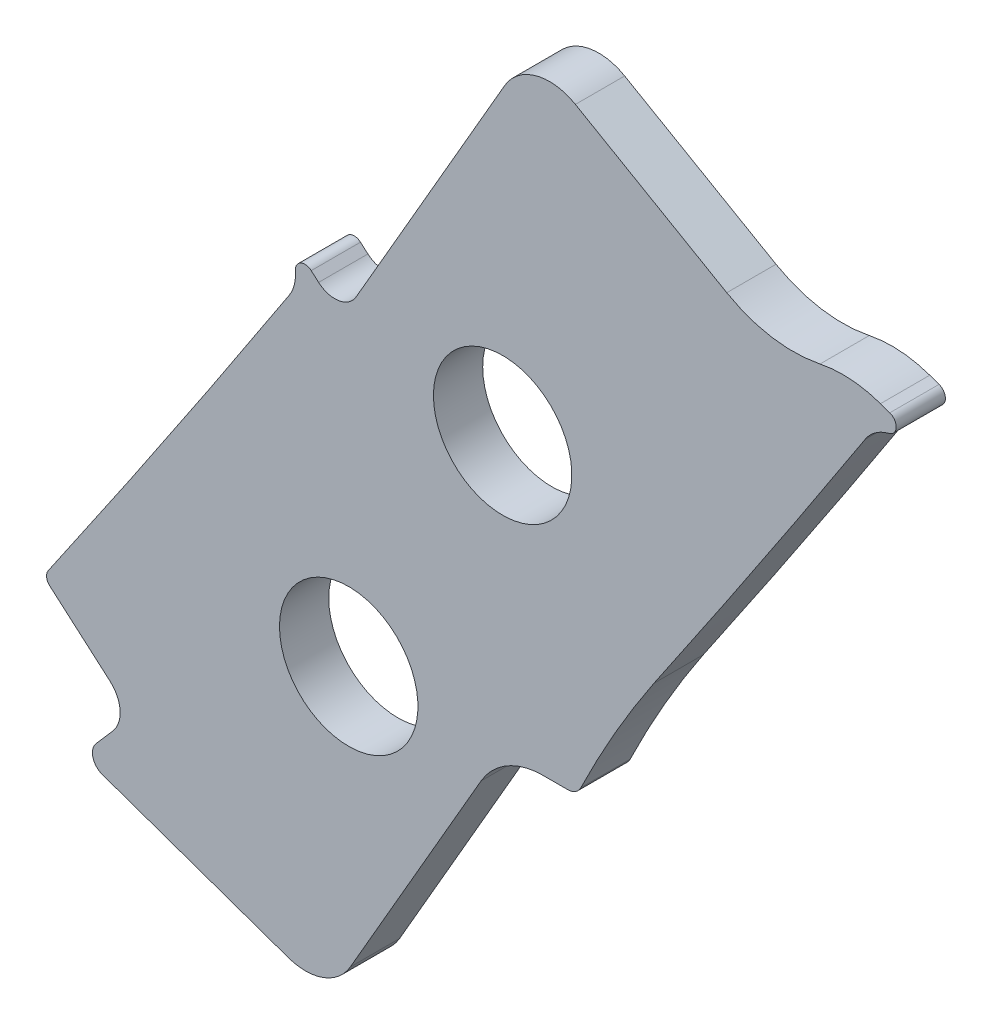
ISO-10303-21;
HEADER;
FILE_DESCRIPTION(('STEP AP214'),'2;1');
FILE_NAME('part.step','',(''),(''),'','','');
FILE_SCHEMA(('AUTOMOTIVE_DESIGN { 1 0 10303 214 1 1 1 1 }'));
ENDSEC;
DATA;
#1=APPLICATION_CONTEXT('core data for automotive mechanical design processes');
#2=APPLICATION_PROTOCOL_DEFINITION('international standard','automotive_design',2000,#1);
#3=PRODUCT_CONTEXT('',#1,'mechanical');
#4=PRODUCT('Part','Part','',(#3));
#5=PRODUCT_RELATED_PRODUCT_CATEGORY('part','',(#4));
#6=PRODUCT_DEFINITION_FORMATION('','',#4);
#7=PRODUCT_DEFINITION_CONTEXT('part definition',#1,'design');
#8=PRODUCT_DEFINITION('design','',#6,#7);
#9=PRODUCT_DEFINITION_SHAPE('','',#8);
#10=(LENGTH_UNIT() NAMED_UNIT(*) SI_UNIT(.MILLI.,.METRE.));
#11=(NAMED_UNIT(*) PLANE_ANGLE_UNIT() SI_UNIT($,.RADIAN.));
#12=(NAMED_UNIT(*) SI_UNIT($,.STERADIAN.) SOLID_ANGLE_UNIT());
#13=UNCERTAINTY_MEASURE_WITH_UNIT(LENGTH_MEASURE(1.E-05),#10,'distance_accuracy_value','');
#14=(GEOMETRIC_REPRESENTATION_CONTEXT(3) GLOBAL_UNCERTAINTY_ASSIGNED_CONTEXT((#13)) GLOBAL_UNIT_ASSIGNED_CONTEXT((#10,
#11,#12)) REPRESENTATION_CONTEXT('',''));
#15=CARTESIAN_POINT('',(0.,0.,0.));
#16=DIRECTION('',(0.,0.,1.));
#17=DIRECTION('',(1.,0.,0.));
#18=AXIS2_PLACEMENT_3D('',#15,#16,#17);
#19=CARTESIAN_POINT('',(-1079.32610530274,4.08105234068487,-2.54));
#20=DIRECTION('',(0.,0.,1.));
#21=DIRECTION('',(1.,0.,0.));
#22=AXIS2_PLACEMENT_3D('',#19,#20,#21);
#23=PLANE('',#22);
#24=CARTESIAN_POINT('',(-1082.675,17.4625,-2.54));
#25=DIRECTION('',(0.,0.,-1.));
#26=DIRECTION('',(-1.,0.,0.));
#27=AXIS2_PLACEMENT_3D('',#24,#25,#26);
#28=CIRCLE('',#27,3.56869999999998);
#29=CARTESIAN_POINT('',(-1086.2437,17.4625,-2.54));
#30=VERTEX_POINT('',#29);
#31=EDGE_CURVE('E468',#30,#30,#28,.T.);
#32=ORIENTED_EDGE('',*,*,#31,.F.);
#33=EDGE_LOOP('',(#32));
#34=FACE_BOUND('',#33,.T.);
#35=CARTESIAN_POINT('',(-1079.32610530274,4.08105234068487,-2.54));
#36=DIRECTION('',(0.,0.,1.));
#37=DIRECTION('',(1.,0.,0.));
#38=AXIS2_PLACEMENT_3D('',#35,#36,#37);
#39=CIRCLE('',#38,0.761999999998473);
#40=CARTESIAN_POINT('',(-1079.32610530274,3.31905234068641,-2.54));
#41=VERTEX_POINT('',#40);
#42=CARTESIAN_POINT('',(-1078.64073042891,3.74802789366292,-2.54));
#43=VERTEX_POINT('',#42);
#44=EDGE_CURVE('E359',#41,#43,#39,.T.);
#45=ORIENTED_EDGE('',*,*,#44,.F.);
#46=DIRECTION('',(1.,-3.95708181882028E-12,0.));
#47=VECTOR('',#46,1.);
#48=CARTESIAN_POINT('',(-1080.59610530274,3.31905234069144,-2.54));
#49=LINE('',#48,#47);
#50=CARTESIAN_POINT('',(-1080.59610530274,3.31905234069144,-2.54));
#51=VERTEX_POINT('',#50);
#52=EDGE_CURVE('E243',#51,#41,#49,.T.);
#53=ORIENTED_EDGE('',*,*,#52,.F.);
#54=CARTESIAN_POINT('',(-1080.59610530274,-0.363947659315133,-2.54));
#55=DIRECTION('',(0.,0.,-1.));
#56=DIRECTION('',(1.,0.,0.));
#57=AXIS2_PLACEMENT_3D('',#54,#55,#56);
#58=CIRCLE('',#57,3.68300000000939);
#59=CARTESIAN_POINT('',(-1083.78567686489,1.47755234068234,-2.54));
#60=VERTEX_POINT('',#59);
#61=EDGE_CURVE('E227',#60,#51,#58,.T.);
#62=ORIENTED_EDGE('',*,*,#61,.F.);
#63=DIRECTION('',(0.500000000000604,0.86602540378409,0.));
#64=VECTOR('',#63,1.);
#65=CARTESIAN_POINT('',(-1090.52925738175,-10.2026717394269,-2.54));
#66=LINE('',#65,#64);
#67=CARTESIAN_POINT('',(-1090.52925738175,-10.2026717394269,-2.54));
#68=VERTEX_POINT('',#67);
#69=EDGE_CURVE('E241',#68,#60,#66,.T.);
#70=ORIENTED_EDGE('',*,*,#69,.F.);
#71=CARTESIAN_POINT('',(-1092.83894713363,-8.86917173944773,-2.54));
#72=DIRECTION('',(0.,0.,1.));
#73=DIRECTION('',(1.,0.,0.));
#74=AXIS2_PLACEMENT_3D('',#71,#72,#73);
#75=CIRCLE('',#74,2.66699999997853);
#76=CARTESIAN_POINT('',(-1093.72551577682,-11.3845017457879,-2.54));
#77=VERTEX_POINT('',#76);
#78=EDGE_CURVE('E248',#77,#68,#75,.T.);
#79=ORIENTED_EDGE('',*,*,#78,.F.);
#80=DIRECTION('',(0.943130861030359,-0.332421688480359,0.));
#81=VECTOR('',#80,1.);
#82=CARTESIAN_POINT('',(-1103.31705452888,-8.00380916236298,-2.54));
#83=LINE('',#82,#81);
#84=CARTESIAN_POINT('',(-1103.31705452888,-8.00380916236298,-2.54));
#85=VERTEX_POINT('',#84);
#86=EDGE_CURVE('E252',#85,#77,#83,.T.);
#87=ORIENTED_EDGE('',*,*,#86,.F.);
#88=CARTESIAN_POINT('',(-1103.06374920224,-7.28514344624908,-2.54));
#89=DIRECTION('',(0.,0.,1.));
#90=DIRECTION('',(1.,0.,0.));
#91=AXIS2_PLACEMENT_3D('',#88,#89,#90);
#92=CIRCLE('',#91,0.762000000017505);
#93=CARTESIAN_POINT('',(-1103.63908213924,-6.78550756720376,-2.54));
#94=VERTEX_POINT('',#93);
#95=EDGE_CURVE('E556',#94,#85,#92,.T.);
#96=ORIENTED_EDGE('',*,*,#95,.F.);
#97=DIRECTION('',(-0.655690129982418,-0.755030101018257,0.));
#98=VECTOR('',#97,1.);
#99=CARTESIAN_POINT('',(-1102.76913566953,-5.78376033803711,-2.54));
#100=LINE('',#99,#98);
#101=CARTESIAN_POINT('',(-1102.76913566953,-5.78376033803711,-2.54));
#102=VERTEX_POINT('',#101);
#103=EDGE_CURVE('E552',#102,#94,#100,.T.);
#104=ORIENTED_EDGE('',*,*,#103,.F.);
#105=CARTESIAN_POINT('',(-1103.91980154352,-4.78448857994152,-2.54));
#106=DIRECTION('',(0.,0.,-1.));
#107=DIRECTION('',(1.,0.,0.));
#108=AXIS2_PLACEMENT_3D('',#105,#106,#107);
#109=CIRCLE('',#108,1.52400000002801);
#110=CARTESIAN_POINT('',(-1102.92052978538,-3.6338227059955,-2.54));
#111=VERTEX_POINT('',#110);
#112=EDGE_CURVE('E548',#111,#102,#109,.T.);
#113=ORIENTED_EDGE('',*,*,#112,.F.);
#114=DIRECTION('',(0.755030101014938,-0.65569012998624,0.));
#115=VECTOR('',#114,1.);
#116=CARTESIAN_POINT('',(-1106.02081050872,-0.941448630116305,-2.54));
#117=LINE('',#116,#115);
#118=CARTESIAN_POINT('',(-1106.02081050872,-0.941448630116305,-2.54));
#119=VERTEX_POINT('',#118);
#120=EDGE_CURVE('E544',#119,#111,#117,.T.);
#121=ORIENTED_EDGE('',*,*,#120,.F.);
#122=CARTESIAN_POINT('',(-1105.69821096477,-0.569973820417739,-2.54));
#123=DIRECTION('',(0.,0.,1.));
#124=DIRECTION('',(1.,0.,0.));
#125=AXIS2_PLACEMENT_3D('',#122,#123,#124);
#126=CIRCLE('',#125,0.491999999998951);
#127=CARTESIAN_POINT('',(-1106.10311749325,-0.290483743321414,-2.54));
#128=VERTEX_POINT('',#127);
#129=EDGE_CURVE('E540',#128,#119,#126,.T.);
#130=ORIENTED_EDGE('',*,*,#129,.F.);
#131=CARTESIAN_POINT('',(-1812.92046147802,487.596028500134,-2.54));
#132=DIRECTION('',(0.,0.,-1.));
#133=DIRECTION('',(1.,0.,0.));
#134=AXIS2_PLACEMENT_3D('',#131,#132,#133);
#135=CIRCLE('',#134,858.850398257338);
#136=CARTESIAN_POINT('',(-1093.68394171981,18.2104351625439,-2.54));
#137=VERTEX_POINT('',#136);
#138=EDGE_CURVE('E536',#137,#128,#135,.T.);
#139=ORIENTED_EDGE('',*,*,#138,.F.);
#140=CARTESIAN_POINT('',(-1095.38562179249,19.3209795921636,-2.54));
#141=DIRECTION('',(0.,0.,-1.));
#142=DIRECTION('',(1.,0.,0.));
#143=AXIS2_PLACEMENT_3D('',#140,#141,#142);
#144=CIRCLE('',#143,2.03200000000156);
#145=CARTESIAN_POINT('',(-1093.35945334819,19.474815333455,-2.54));
#146=VERTEX_POINT('',#145);
#147=EDGE_CURVE('E532',#146,#137,#144,.T.);
#148=ORIENTED_EDGE('',*,*,#147,.F.);
#149=CARTESIAN_POINT('',(-1092.86886531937,19.5120629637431,-2.54));
#150=DIRECTION('',(0.,0.,1.));
#151=DIRECTION('',(1.,0.,0.));
#152=AXIS2_PLACEMENT_3D('',#149,#150,#151);
#153=CIRCLE('',#152,0.491999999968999);
#154=CARTESIAN_POINT('',(-1092.54530847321,19.8827042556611,-2.54));
#155=VERTEX_POINT('',#154);
#156=EDGE_CURVE('E528',#155,#146,#153,.T.);
#157=ORIENTED_EDGE('',*,*,#156,.F.);
#158=DIRECTION('',(-0.753335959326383,0.657635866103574,0.));
#159=VECTOR('',#158,1.);
#160=CARTESIAN_POINT('',(-1092.16261380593,19.5486252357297,-2.54));
#161=LINE('',#160,#159);
#162=CARTESIAN_POINT('',(-1092.16261380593,19.5486252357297,-2.54));
#163=VERTEX_POINT('',#162);
#164=EDGE_CURVE('E524',#163,#155,#161,.T.);
#165=ORIENTED_EDGE('',*,*,#164,.F.);
#166=CARTESIAN_POINT('',(-1091.32741625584,20.5053619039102,-2.54));
#167=DIRECTION('',(0.,0.,-1.));
#168=DIRECTION('',(1.,0.,0.));
#169=AXIS2_PLACEMENT_3D('',#166,#167,#168);
#170=CIRCLE('',#169,1.26999999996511);
#171=CARTESIAN_POINT('',(-1090.22756399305,19.8703619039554,-2.54));
#172=VERTEX_POINT('',#171);
#173=EDGE_CURVE('E520',#172,#163,#170,.T.);
#174=ORIENTED_EDGE('',*,*,#173,.F.);
#175=DIRECTION('',(-0.500000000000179,-0.866025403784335,0.));
#176=VECTOR('',#175,1.);
#177=CARTESIAN_POINT('',(-1082.56644444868,33.1398101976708,-2.54));
#178=LINE('',#177,#176);
#179=CARTESIAN_POINT('',(-1082.56644444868,33.1398101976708,-2.54));
#180=VERTEX_POINT('',#179);
#181=EDGE_CURVE('E516',#180,#172,#178,.T.);
#182=ORIENTED_EDGE('',*,*,#181,.F.);
#183=CARTESIAN_POINT('',(-1080.25675469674,31.806310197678,-2.54));
#184=DIRECTION('',(0.,0.,1.));
#185=DIRECTION('',(1.,0.,0.));
#186=AXIS2_PLACEMENT_3D('',#183,#184,#185);
#187=CIRCLE('',#186,2.66700000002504);
#188=CARTESIAN_POINT('',(-1078.92325469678,34.1159999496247,-2.54));
#189=VERTEX_POINT('',#188);
#190=EDGE_CURVE('E512',#189,#180,#187,.T.);
#191=ORIENTED_EDGE('',*,*,#190,.F.);
#192=DIRECTION('',(-0.86602540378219,0.500000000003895,0.));
#193=VECTOR('',#192,1.);
#194=CARTESIAN_POINT('',(-1071.11913012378,29.6102865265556,-2.54));
#195=LINE('',#194,#193);
#196=CARTESIAN_POINT('',(-1071.11913012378,29.6102865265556,-2.54));
#197=VERTEX_POINT('',#196);
#198=EDGE_CURVE('E508',#197,#189,#195,.T.);
#199=ORIENTED_EDGE('',*,*,#198,.F.);
#200=CARTESIAN_POINT('',(-1067.69013012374,35.5494887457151,-2.54));
#201=DIRECTION('',(0.,0.,-1.));
#202=DIRECTION('',(1.,0.,0.));
#203=AXIS2_PLACEMENT_3D('',#200,#201,#202);
#204=CIRCLE('',#203,6.85800000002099);
#205=CARTESIAN_POINT('',(-1066.30960685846,28.8318761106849,-2.54));
#206=VERTEX_POINT('',#205);
#207=EDGE_CURVE('E504',#206,#197,#204,.T.);
#208=ORIENTED_EDGE('',*,*,#207,.F.);
#209=CARTESIAN_POINT('',(-1065.13360555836,23.109465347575,-2.54));
#210=DIRECTION('',(0.,0.,1.));
#211=DIRECTION('',(1.,0.,0.));
#212=AXIS2_PLACEMENT_3D('',#209,#210,#211);
#213=CIRCLE('',#212,5.84199999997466);
#214=CARTESIAN_POINT('',(-1063.19159805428,28.6192358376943,-2.54));
#215=VERTEX_POINT('',#214);
#216=EDGE_CURVE('E500',#215,#206,#213,.T.);
#217=ORIENTED_EDGE('',*,*,#216,.F.);
#218=DIRECTION('',(-0.943130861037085,0.332421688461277,0.));
#219=VECTOR('',#218,1.);
#220=CARTESIAN_POINT('',(-1062.71248757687,28.450365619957,-2.54));
#221=LINE('',#220,#219);
#222=CARTESIAN_POINT('',(-1062.71248757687,28.450365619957,-2.54));
#223=VERTEX_POINT('',#222);
#224=EDGE_CURVE('E496',#223,#215,#221,.T.);
#225=ORIENTED_EDGE('',*,*,#224,.F.);
#226=CARTESIAN_POINT('',(-1062.8760390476,27.9863452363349,-2.54));
#227=DIRECTION('',(0.,0.,1.));
#228=DIRECTION('',(1.,0.,0.));
#229=AXIS2_PLACEMENT_3D('',#226,#227,#228);
#230=CIRCLE('',#229,0.492000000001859);
#231=CARTESIAN_POINT('',(-1062.75789083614,27.5087418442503,-2.54));
#232=VERTEX_POINT('',#231);
#233=EDGE_CURVE('E492',#232,#223,#230,.T.);
#234=ORIENTED_EDGE('',*,*,#233,.F.);
#235=CARTESIAN_POINT('',(-1062.26992911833,25.5362010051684,-2.54));
#236=DIRECTION('',(0.,0.,-1.));
#237=DIRECTION('',(1.,0.,0.));
#238=AXIS2_PLACEMENT_3D('',#235,#236,#237);
#239=CIRCLE('',#238,2.03199999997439);
#240=CARTESIAN_POINT('',(-1063.97367377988,26.6435754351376,-2.54));
#241=VERTEX_POINT('',#240);
#242=EDGE_CURVE('E488',#241,#232,#239,.T.);
#243=ORIENTED_EDGE('',*,*,#242,.F.);
#244=CARTESIAN_POINT('',(-1773.16946147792,487.596028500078,-2.54));
#245=DIRECTION('',(0.,0.,1.));
#246=DIRECTION('',(1.,0.,0.));
#247=AXIS2_PLACEMENT_3D('',#244,#245,#246);
#248=CIRCLE('',#247,845.834398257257);
#249=CARTESIAN_POINT('',(-1074.87126398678,10.2958539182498,-2.54));
#250=VERTEX_POINT('',#249);
#251=EDGE_CURVE('E484',#250,#241,#248,.T.);
#252=ORIENTED_EDGE('',*,*,#251,.F.);
#253=CARTESIAN_POINT('',(-1030.09012737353,-19.8427665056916,-2.54));
#254=DIRECTION('',(0.,0.,-1.));
#255=DIRECTION('',(1.,0.,0.));
#256=AXIS2_PLACEMENT_3D('',#253,#254,#255);
#257=CIRCLE('',#256,53.9785757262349);
#258=EDGE_CURVE('E481',#43,#250,#257,.T.);
#259=ORIENTED_EDGE('',*,*,#258,.F.);
#260=EDGE_LOOP('',(#45,#53,#62,#70,#79,#87,#96,#104,#113,#121,#130,#139,#148,#157,#165,#174,
#182,#191,#199,#208,#217,#225,#234,#243,#252,#259));
#261=FACE_BOUND('',#260,.T.);
#262=CARTESIAN_POINT('',(-1090.6125,3.175,-2.54));
#263=DIRECTION('',(0.,0.,-1.));
#264=DIRECTION('',(-1.,0.,0.));
#265=AXIS2_PLACEMENT_3D('',#262,#263,#264);
#266=CIRCLE('',#265,3.56869999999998);
#267=CARTESIAN_POINT('',(-1094.1812,3.175,-2.54));
#268=VERTEX_POINT('',#267);
#269=EDGE_CURVE('E263',#268,#268,#266,.T.);
#270=ORIENTED_EDGE('',*,*,#269,.F.);
#271=EDGE_LOOP('',(#270));
#272=FACE_BOUND('',#271,.T.);
#273=ADVANCED_FACE('F45',(#34,#261,#272),#23,.F.);
#274=CARTESIAN_POINT('',(-1079.32610530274,4.08105234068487,-2.54));
#275=DIRECTION('',(0.,0.,1.));
#276=DIRECTION('',(1.,0.,0.));
#277=AXIS2_PLACEMENT_3D('',#274,#275,#276);
#278=CYLINDRICAL_SURFACE('',#277,0.761999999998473);
#279=CARTESIAN_POINT('',(-1079.32610530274,4.08105234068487,0.));
#280=DIRECTION('',(0.,0.,1.));
#281=DIRECTION('',(1.,0.,0.));
#282=AXIS2_PLACEMENT_3D('',#279,#280,#281);
#283=CIRCLE('',#282,0.761999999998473);
#284=CARTESIAN_POINT('',(-1079.32610530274,3.31905234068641,0.));
#285=VERTEX_POINT('',#284);
#286=CARTESIAN_POINT('',(-1078.64073042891,3.74802789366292,0.));
#287=VERTEX_POINT('',#286);
#288=EDGE_CURVE('E258',#285,#287,#283,.T.);
#289=ORIENTED_EDGE('',*,*,#288,.F.);
#290=DIRECTION('',(0.,0.,1.));
#291=VECTOR('',#290,1.);
#292=CARTESIAN_POINT('',(-1079.32610530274,3.31905234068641,-2.54));
#293=LINE('',#292,#291);
#294=EDGE_CURVE('E11',#41,#285,#293,.T.);
#295=ORIENTED_EDGE('',*,*,#294,.F.);
#296=ORIENTED_EDGE('',*,*,#44,.T.);
#297=DIRECTION('',(0.,0.,1.));
#298=VECTOR('',#297,1.);
#299=CARTESIAN_POINT('',(-1078.64073042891,3.74802789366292,-2.54));
#300=LINE('',#299,#298);
#301=EDGE_CURVE('E49',#43,#287,#300,.T.);
#302=ORIENTED_EDGE('',*,*,#301,.T.);
#303=EDGE_LOOP('',(#289,#295,#296,#302));
#304=FACE_BOUND('',#303,.T.);
#305=ADVANCED_FACE('F47',(#304),#278,.T.);
#306=CARTESIAN_POINT('',(-1080.59610530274,3.31905234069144,-2.54));
#307=DIRECTION('',(-3.95708181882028E-12,-1.,0.));
#308=DIRECTION('',(1.,-3.95708181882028E-12,0.));
#309=AXIS2_PLACEMENT_3D('',#306,#307,#308);
#310=PLANE('',#309);
#311=DIRECTION('',(1.,-3.95708181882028E-12,0.));
#312=VECTOR('',#311,1.);
#313=CARTESIAN_POINT('',(-1080.59610530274,3.31905234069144,0.));
#314=LINE('',#313,#312);
#315=CARTESIAN_POINT('',(-1080.59610530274,3.31905234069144,0.));
#316=VERTEX_POINT('',#315);
#317=EDGE_CURVE('E356',#316,#285,#314,.T.);
#318=ORIENTED_EDGE('',*,*,#317,.F.);
#319=DIRECTION('',(0.,0.,1.));
#320=VECTOR('',#319,1.);
#321=CARTESIAN_POINT('',(-1080.59610530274,3.31905234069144,-2.54));
#322=LINE('',#321,#320);
#323=EDGE_CURVE('E56',#51,#316,#322,.T.);
#324=ORIENTED_EDGE('',*,*,#323,.F.);
#325=ORIENTED_EDGE('',*,*,#52,.T.);
#326=ORIENTED_EDGE('',*,*,#294,.T.);
#327=EDGE_LOOP('',(#318,#324,#325,#326));
#328=FACE_BOUND('',#327,.T.);
#329=ADVANCED_FACE('F433',(#328),#310,.T.);
#330=CARTESIAN_POINT('',(-1080.59610530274,-0.363947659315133,-2.54));
#331=DIRECTION('',(0.,0.,1.));
#332=DIRECTION('',(1.,0.,0.));
#333=AXIS2_PLACEMENT_3D('',#330,#331,#332);
#334=CYLINDRICAL_SURFACE('',#333,3.68300000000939);
#335=CARTESIAN_POINT('',(-1080.59610530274,-0.363947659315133,0.));
#336=DIRECTION('',(0.,0.,-1.));
#337=DIRECTION('',(1.,0.,0.));
#338=AXIS2_PLACEMENT_3D('',#335,#336,#337);
#339=CIRCLE('',#338,3.68300000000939);
#340=CARTESIAN_POINT('',(-1083.78567686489,1.47755234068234,0.));
#341=VERTEX_POINT('',#340);
#342=EDGE_CURVE('E229',#341,#316,#339,.T.);
#343=ORIENTED_EDGE('',*,*,#342,.F.);
#344=DIRECTION('',(0.,0.,1.));
#345=VECTOR('',#344,1.);
#346=CARTESIAN_POINT('',(-1083.78567686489,1.47755234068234,-2.54));
#347=LINE('',#346,#345);
#348=EDGE_CURVE('E224',#60,#341,#347,.T.);
#349=ORIENTED_EDGE('',*,*,#348,.F.);
#350=ORIENTED_EDGE('',*,*,#61,.T.);
#351=ORIENTED_EDGE('',*,*,#323,.T.);
#352=EDGE_LOOP('',(#343,#349,#350,#351));
#353=FACE_BOUND('',#352,.T.);
#354=ADVANCED_FACE('F226',(#353),#334,.F.);
#355=CARTESIAN_POINT('',(-1090.52925738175,-10.2026717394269,-2.54));
#356=DIRECTION('',(0.86602540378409,-0.500000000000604,0.));
#357=DIRECTION('',(0.500000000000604,0.86602540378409,0.));
#358=AXIS2_PLACEMENT_3D('',#355,#356,#357);
#359=PLANE('',#358);
#360=DIRECTION('',(0.500000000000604,0.86602540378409,0.));
#361=VECTOR('',#360,1.);
#362=CARTESIAN_POINT('',(-1090.52925738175,-10.2026717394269,0.));
#363=LINE('',#362,#361);
#364=CARTESIAN_POINT('',(-1090.52925738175,-10.2026717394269,0.));
#365=VERTEX_POINT('',#364);
#366=EDGE_CURVE('E351',#365,#341,#363,.T.);
#367=ORIENTED_EDGE('',*,*,#366,.F.);
#368=DIRECTION('',(0.,0.,1.));
#369=VECTOR('',#368,1.);
#370=CARTESIAN_POINT('',(-1090.52925738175,-10.2026717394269,-2.54));
#371=LINE('',#370,#369);
#372=EDGE_CURVE('E235',#68,#365,#371,.T.);
#373=ORIENTED_EDGE('',*,*,#372,.F.);
#374=ORIENTED_EDGE('',*,*,#69,.T.);
#375=ORIENTED_EDGE('',*,*,#348,.T.);
#376=EDGE_LOOP('',(#367,#373,#374,#375));
#377=FACE_BOUND('',#376,.T.);
#378=ADVANCED_FACE('F246',(#377),#359,.T.);
#379=CARTESIAN_POINT('',(-1092.83894713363,-8.86917173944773,-2.54));
#380=DIRECTION('',(0.,0.,1.));
#381=DIRECTION('',(1.,0.,0.));
#382=AXIS2_PLACEMENT_3D('',#379,#380,#381);
#383=CYLINDRICAL_SURFACE('',#382,2.66699999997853);
#384=CARTESIAN_POINT('',(-1092.83894713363,-8.86917173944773,0.));
#385=DIRECTION('',(0.,0.,1.));
#386=DIRECTION('',(1.,0.,0.));
#387=AXIS2_PLACEMENT_3D('',#384,#385,#386);
#388=CIRCLE('',#387,2.66699999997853);
#389=CARTESIAN_POINT('',(-1093.72551577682,-11.3845017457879,0.));
#390=VERTEX_POINT('',#389);
#391=EDGE_CURVE('E347',#390,#365,#388,.T.);
#392=ORIENTED_EDGE('',*,*,#391,.F.);
#393=DIRECTION('',(0.,0.,1.));
#394=VECTOR('',#393,1.);
#395=CARTESIAN_POINT('',(-1093.72551577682,-11.3845017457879,-2.54));
#396=LINE('',#395,#394);
#397=EDGE_CURVE('E365',#77,#390,#396,.T.);
#398=ORIENTED_EDGE('',*,*,#397,.F.);
#399=ORIENTED_EDGE('',*,*,#78,.T.);
#400=ORIENTED_EDGE('',*,*,#372,.T.);
#401=EDGE_LOOP('',(#392,#398,#399,#400));
#402=FACE_BOUND('',#401,.T.);
#403=ADVANCED_FACE('F642',(#402),#383,.T.);
#404=CARTESIAN_POINT('',(-1103.31705452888,-8.00380916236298,-2.54));
#405=DIRECTION('',(-0.332421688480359,-0.943130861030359,0.));
#406=DIRECTION('',(0.943130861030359,-0.332421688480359,0.));
#407=AXIS2_PLACEMENT_3D('',#404,#405,#406);
#408=PLANE('',#407);
#409=DIRECTION('',(0.943130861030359,-0.332421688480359,0.));
#410=VECTOR('',#409,1.);
#411=CARTESIAN_POINT('',(-1103.31705452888,-8.00380916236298,0.));
#412=LINE('',#411,#410);
#413=CARTESIAN_POINT('',(-1103.31705452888,-8.00380916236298,0.));
#414=VERTEX_POINT('',#413);
#415=EDGE_CURVE('E343',#414,#390,#412,.T.);
#416=ORIENTED_EDGE('',*,*,#415,.F.);
#417=DIRECTION('',(0.,0.,1.));
#418=VECTOR('',#417,1.);
#419=CARTESIAN_POINT('',(-1103.31705452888,-8.00380916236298,-2.54));
#420=LINE('',#419,#418);
#421=EDGE_CURVE('E368',#85,#414,#420,.T.);
#422=ORIENTED_EDGE('',*,*,#421,.F.);
#423=ORIENTED_EDGE('',*,*,#86,.T.);
#424=ORIENTED_EDGE('',*,*,#397,.T.);
#425=EDGE_LOOP('',(#416,#422,#423,#424));
#426=FACE_BOUND('',#425,.T.);
#427=ADVANCED_FACE('F565',(#426),#408,.T.);
#428=CARTESIAN_POINT('',(-1103.06374920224,-7.28514344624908,-2.54));
#429=DIRECTION('',(0.,0.,1.));
#430=DIRECTION('',(1.,0.,0.));
#431=AXIS2_PLACEMENT_3D('',#428,#429,#430);
#432=CYLINDRICAL_SURFACE('',#431,0.762000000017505);
#433=CARTESIAN_POINT('',(-1103.06374920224,-7.28514344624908,0.));
#434=DIRECTION('',(0.,0.,1.));
#435=DIRECTION('',(1.,0.,0.));
#436=AXIS2_PLACEMENT_3D('',#433,#434,#435);
#437=CIRCLE('',#436,0.762000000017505);
#438=CARTESIAN_POINT('',(-1103.63908213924,-6.78550756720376,0.));
#439=VERTEX_POINT('',#438);
#440=EDGE_CURVE('E339',#439,#414,#437,.T.);
#441=ORIENTED_EDGE('',*,*,#440,.F.);
#442=DIRECTION('',(0.,0.,1.));
#443=VECTOR('',#442,1.);
#444=CARTESIAN_POINT('',(-1103.63908213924,-6.78550756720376,-2.54));
#445=LINE('',#444,#443);
#446=EDGE_CURVE('E371',#94,#439,#445,.T.);
#447=ORIENTED_EDGE('',*,*,#446,.F.);
#448=ORIENTED_EDGE('',*,*,#95,.T.);
#449=ORIENTED_EDGE('',*,*,#421,.T.);
#450=EDGE_LOOP('',(#441,#447,#448,#449));
#451=FACE_BOUND('',#450,.T.);
#452=ADVANCED_FACE('F571',(#451),#432,.T.);
#453=CARTESIAN_POINT('',(-1102.76913566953,-5.78376033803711,-2.54));
#454=DIRECTION('',(-0.755030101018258,0.655690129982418,0.));
#455=DIRECTION('',(-0.655690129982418,-0.755030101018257,0.));
#456=AXIS2_PLACEMENT_3D('',#453,#454,#455);
#457=PLANE('',#456);
#458=DIRECTION('',(-0.655690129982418,-0.755030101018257,0.));
#459=VECTOR('',#458,1.);
#460=CARTESIAN_POINT('',(-1102.76913566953,-5.78376033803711,0.));
#461=LINE('',#460,#459);
#462=CARTESIAN_POINT('',(-1102.76913566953,-5.78376033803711,0.));
#463=VERTEX_POINT('',#462);
#464=EDGE_CURVE('E335',#463,#439,#461,.T.);
#465=ORIENTED_EDGE('',*,*,#464,.F.);
#466=DIRECTION('',(0.,0.,1.));
#467=VECTOR('',#466,1.);
#468=CARTESIAN_POINT('',(-1102.76913566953,-5.78376033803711,-2.54));
#469=LINE('',#468,#467);
#470=EDGE_CURVE('E374',#102,#463,#469,.T.);
#471=ORIENTED_EDGE('',*,*,#470,.F.);
#472=ORIENTED_EDGE('',*,*,#103,.T.);
#473=ORIENTED_EDGE('',*,*,#446,.T.);
#474=EDGE_LOOP('',(#465,#471,#472,#473));
#475=FACE_BOUND('',#474,.T.);
#476=ADVANCED_FACE('F574',(#475),#457,.T.);
#477=CARTESIAN_POINT('',(-1103.91980154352,-4.78448857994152,-2.54));
#478=DIRECTION('',(0.,0.,1.));
#479=DIRECTION('',(1.,0.,0.));
#480=AXIS2_PLACEMENT_3D('',#477,#478,#479);
#481=CYLINDRICAL_SURFACE('',#480,1.52400000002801);
#482=CARTESIAN_POINT('',(-1103.91980154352,-4.78448857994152,0.));
#483=DIRECTION('',(0.,0.,-1.));
#484=DIRECTION('',(1.,0.,0.));
#485=AXIS2_PLACEMENT_3D('',#482,#483,#484);
#486=CIRCLE('',#485,1.52400000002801);
#487=CARTESIAN_POINT('',(-1102.92052978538,-3.6338227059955,0.));
#488=VERTEX_POINT('',#487);
#489=EDGE_CURVE('E331',#488,#463,#486,.T.);
#490=ORIENTED_EDGE('',*,*,#489,.F.);
#491=DIRECTION('',(0.,0.,1.));
#492=VECTOR('',#491,1.);
#493=CARTESIAN_POINT('',(-1102.92052978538,-3.6338227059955,-2.54));
#494=LINE('',#493,#492);
#495=EDGE_CURVE('E377',#111,#488,#494,.T.);
#496=ORIENTED_EDGE('',*,*,#495,.F.);
#497=ORIENTED_EDGE('',*,*,#112,.T.);
#498=ORIENTED_EDGE('',*,*,#470,.T.);
#499=EDGE_LOOP('',(#490,#496,#497,#498));
#500=FACE_BOUND('',#499,.T.);
#501=ADVANCED_FACE('F579',(#500),#481,.F.);
#502=CARTESIAN_POINT('',(-1106.02081050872,-0.941448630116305,-2.54));
#503=DIRECTION('',(-0.65569012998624,-0.755030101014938,0.));
#504=DIRECTION('',(0.755030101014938,-0.65569012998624,0.));
#505=AXIS2_PLACEMENT_3D('',#502,#503,#504);
#506=PLANE('',#505);
#507=DIRECTION('',(0.755030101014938,-0.65569012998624,0.));
#508=VECTOR('',#507,1.);
#509=CARTESIAN_POINT('',(-1106.02081050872,-0.941448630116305,0.));
#510=LINE('',#509,#508);
#511=CARTESIAN_POINT('',(-1106.02081050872,-0.941448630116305,0.));
#512=VERTEX_POINT('',#511);
#513=EDGE_CURVE('E327',#512,#488,#510,.T.);
#514=ORIENTED_EDGE('',*,*,#513,.F.);
#515=DIRECTION('',(0.,0.,1.));
#516=VECTOR('',#515,1.);
#517=CARTESIAN_POINT('',(-1106.02081050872,-0.941448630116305,-2.54));
#518=LINE('',#517,#516);
#519=EDGE_CURVE('E380',#119,#512,#518,.T.);
#520=ORIENTED_EDGE('',*,*,#519,.F.);
#521=ORIENTED_EDGE('',*,*,#120,.T.);
#522=ORIENTED_EDGE('',*,*,#495,.T.);
#523=EDGE_LOOP('',(#514,#520,#521,#522));
#524=FACE_BOUND('',#523,.T.);
#525=ADVANCED_FACE('F582',(#524),#506,.T.);
#526=CARTESIAN_POINT('',(-1105.69821096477,-0.569973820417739,-2.54));
#527=DIRECTION('',(0.,0.,1.));
#528=DIRECTION('',(1.,0.,0.));
#529=AXIS2_PLACEMENT_3D('',#526,#527,#528);
#530=CYLINDRICAL_SURFACE('',#529,0.491999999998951);
#531=CARTESIAN_POINT('',(-1105.69821096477,-0.569973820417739,0.));
#532=DIRECTION('',(0.,0.,1.));
#533=DIRECTION('',(1.,0.,0.));
#534=AXIS2_PLACEMENT_3D('',#531,#532,#533);
#535=CIRCLE('',#534,0.491999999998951);
#536=CARTESIAN_POINT('',(-1106.10311749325,-0.290483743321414,0.));
#537=VERTEX_POINT('',#536);
#538=EDGE_CURVE('E323',#537,#512,#535,.T.);
#539=ORIENTED_EDGE('',*,*,#538,.F.);
#540=DIRECTION('',(0.,0.,1.));
#541=VECTOR('',#540,1.);
#542=CARTESIAN_POINT('',(-1106.10311749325,-0.290483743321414,-2.54));
#543=LINE('',#542,#541);
#544=EDGE_CURVE('E383',#128,#537,#543,.T.);
#545=ORIENTED_EDGE('',*,*,#544,.F.);
#546=ORIENTED_EDGE('',*,*,#129,.T.);
#547=ORIENTED_EDGE('',*,*,#519,.T.);
#548=EDGE_LOOP('',(#539,#545,#546,#547));
#549=FACE_BOUND('',#548,.T.);
#550=ADVANCED_FACE('F587',(#549),#530,.T.);
#551=CARTESIAN_POINT('',(-1812.92046147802,487.596028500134,-2.54));
#552=DIRECTION('',(0.,0.,1.));
#553=DIRECTION('',(1.,0.,0.));
#554=AXIS2_PLACEMENT_3D('',#551,#552,#553);
#555=CYLINDRICAL_SURFACE('',#554,858.850398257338);
#556=CARTESIAN_POINT('',(-1812.92046147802,487.596028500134,0.));
#557=DIRECTION('',(0.,0.,-1.));
#558=DIRECTION('',(1.,0.,0.));
#559=AXIS2_PLACEMENT_3D('',#556,#557,#558);
#560=CIRCLE('',#559,858.850398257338);
#561=CARTESIAN_POINT('',(-1093.68394171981,18.2104351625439,0.));
#562=VERTEX_POINT('',#561);
#563=EDGE_CURVE('E319',#562,#537,#560,.T.);
#564=ORIENTED_EDGE('',*,*,#563,.F.);
#565=DIRECTION('',(0.,0.,1.));
#566=VECTOR('',#565,1.);
#567=CARTESIAN_POINT('',(-1093.68394171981,18.2104351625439,-2.54));
#568=LINE('',#567,#566);
#569=EDGE_CURVE('E386',#137,#562,#568,.T.);
#570=ORIENTED_EDGE('',*,*,#569,.F.);
#571=ORIENTED_EDGE('',*,*,#138,.T.);
#572=ORIENTED_EDGE('',*,*,#544,.T.);
#573=EDGE_LOOP('',(#564,#570,#571,#572));
#574=FACE_BOUND('',#573,.T.);
#575=ADVANCED_FACE('F590',(#574),#555,.F.);
#576=CARTESIAN_POINT('',(-1095.38562179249,19.3209795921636,-2.54));
#577=DIRECTION('',(0.,0.,1.));
#578=DIRECTION('',(1.,0.,0.));
#579=AXIS2_PLACEMENT_3D('',#576,#577,#578);
#580=CYLINDRICAL_SURFACE('',#579,2.03200000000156);
#581=CARTESIAN_POINT('',(-1095.38562179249,19.3209795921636,0.));
#582=DIRECTION('',(0.,0.,-1.));
#583=DIRECTION('',(1.,0.,0.));
#584=AXIS2_PLACEMENT_3D('',#581,#582,#583);
#585=CIRCLE('',#584,2.03200000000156);
#586=CARTESIAN_POINT('',(-1093.35945334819,19.474815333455,0.));
#587=VERTEX_POINT('',#586);
#588=EDGE_CURVE('E315',#587,#562,#585,.T.);
#589=ORIENTED_EDGE('',*,*,#588,.F.);
#590=DIRECTION('',(0.,0.,1.));
#591=VECTOR('',#590,1.);
#592=CARTESIAN_POINT('',(-1093.35945334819,19.474815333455,-2.54));
#593=LINE('',#592,#591);
#594=EDGE_CURVE('E389',#146,#587,#593,.T.);
#595=ORIENTED_EDGE('',*,*,#594,.F.);
#596=ORIENTED_EDGE('',*,*,#147,.T.);
#597=ORIENTED_EDGE('',*,*,#569,.T.);
#598=EDGE_LOOP('',(#589,#595,#596,#597));
#599=FACE_BOUND('',#598,.T.);
#600=ADVANCED_FACE('F595',(#599),#580,.F.);
#601=CARTESIAN_POINT('',(-1092.86886531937,19.5120629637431,-2.54));
#602=DIRECTION('',(0.,0.,1.));
#603=DIRECTION('',(1.,0.,0.));
#604=AXIS2_PLACEMENT_3D('',#601,#602,#603);
#605=CYLINDRICAL_SURFACE('',#604,0.491999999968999);
#606=CARTESIAN_POINT('',(-1092.86886531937,19.5120629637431,0.));
#607=DIRECTION('',(0.,0.,1.));
#608=DIRECTION('',(1.,0.,0.));
#609=AXIS2_PLACEMENT_3D('',#606,#607,#608);
#610=CIRCLE('',#609,0.491999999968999);
#611=CARTESIAN_POINT('',(-1092.54530847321,19.8827042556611,0.));
#612=VERTEX_POINT('',#611);
#613=EDGE_CURVE('E311',#612,#587,#610,.T.);
#614=ORIENTED_EDGE('',*,*,#613,.F.);
#615=DIRECTION('',(0.,0.,1.));
#616=VECTOR('',#615,1.);
#617=CARTESIAN_POINT('',(-1092.54530847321,19.8827042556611,-2.54));
#618=LINE('',#617,#616);
#619=EDGE_CURVE('E392',#155,#612,#618,.T.);
#620=ORIENTED_EDGE('',*,*,#619,.F.);
#621=ORIENTED_EDGE('',*,*,#156,.T.);
#622=ORIENTED_EDGE('',*,*,#594,.T.);
#623=EDGE_LOOP('',(#614,#620,#621,#622));
#624=FACE_BOUND('',#623,.T.);
#625=ADVANCED_FACE('F598',(#624),#605,.T.);
#626=CARTESIAN_POINT('',(-1092.16261380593,19.5486252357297,-2.54));
#627=DIRECTION('',(0.657635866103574,0.753335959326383,0.));
#628=DIRECTION('',(-0.753335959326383,0.657635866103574,0.));
#629=AXIS2_PLACEMENT_3D('',#626,#627,#628);
#630=PLANE('',#629);
#631=DIRECTION('',(-0.753335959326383,0.657635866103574,0.));
#632=VECTOR('',#631,1.);
#633=CARTESIAN_POINT('',(-1092.16261380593,19.5486252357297,0.));
#634=LINE('',#633,#632);
#635=CARTESIAN_POINT('',(-1092.16261380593,19.5486252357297,0.));
#636=VERTEX_POINT('',#635);
#637=EDGE_CURVE('E307',#636,#612,#634,.T.);
#638=ORIENTED_EDGE('',*,*,#637,.F.);
#639=DIRECTION('',(0.,0.,1.));
#640=VECTOR('',#639,1.);
#641=CARTESIAN_POINT('',(-1092.16261380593,19.5486252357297,-2.54));
#642=LINE('',#641,#640);
#643=EDGE_CURVE('E395',#163,#636,#642,.T.);
#644=ORIENTED_EDGE('',*,*,#643,.F.);
#645=ORIENTED_EDGE('',*,*,#164,.T.);
#646=ORIENTED_EDGE('',*,*,#619,.T.);
#647=EDGE_LOOP('',(#638,#644,#645,#646));
#648=FACE_BOUND('',#647,.T.);
#649=ADVANCED_FACE('F603',(#648),#630,.T.);
#650=CARTESIAN_POINT('',(-1091.32741625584,20.5053619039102,-2.54));
#651=DIRECTION('',(0.,0.,1.));
#652=DIRECTION('',(1.,0.,0.));
#653=AXIS2_PLACEMENT_3D('',#650,#651,#652);
#654=CYLINDRICAL_SURFACE('',#653,1.26999999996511);
#655=CARTESIAN_POINT('',(-1091.32741625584,20.5053619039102,0.));
#656=DIRECTION('',(0.,0.,-1.));
#657=DIRECTION('',(1.,0.,0.));
#658=AXIS2_PLACEMENT_3D('',#655,#656,#657);
#659=CIRCLE('',#658,1.26999999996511);
#660=CARTESIAN_POINT('',(-1090.22756399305,19.8703619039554,0.));
#661=VERTEX_POINT('',#660);
#662=EDGE_CURVE('E303',#661,#636,#659,.T.);
#663=ORIENTED_EDGE('',*,*,#662,.F.);
#664=DIRECTION('',(0.,0.,1.));
#665=VECTOR('',#664,1.);
#666=CARTESIAN_POINT('',(-1090.22756399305,19.8703619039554,-2.54));
#667=LINE('',#666,#665);
#668=EDGE_CURVE('E398',#172,#661,#667,.T.);
#669=ORIENTED_EDGE('',*,*,#668,.F.);
#670=ORIENTED_EDGE('',*,*,#173,.T.);
#671=ORIENTED_EDGE('',*,*,#643,.T.);
#672=EDGE_LOOP('',(#663,#669,#670,#671));
#673=FACE_BOUND('',#672,.T.);
#674=ADVANCED_FACE('F606',(#673),#654,.F.);
#675=CARTESIAN_POINT('',(-1082.56644444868,33.1398101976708,-2.54));
#676=DIRECTION('',(-0.866025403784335,0.500000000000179,0.));
#677=DIRECTION('',(-0.500000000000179,-0.866025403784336,0.));
#678=AXIS2_PLACEMENT_3D('',#675,#676,#677);
#679=PLANE('',#678);
#680=DIRECTION('',(-0.500000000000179,-0.866025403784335,0.));
#681=VECTOR('',#680,1.);
#682=CARTESIAN_POINT('',(-1082.56644444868,33.1398101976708,0.));
#683=LINE('',#682,#681);
#684=CARTESIAN_POINT('',(-1082.56644444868,33.1398101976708,0.));
#685=VERTEX_POINT('',#684);
#686=EDGE_CURVE('E299',#685,#661,#683,.T.);
#687=ORIENTED_EDGE('',*,*,#686,.F.);
#688=DIRECTION('',(0.,0.,1.));
#689=VECTOR('',#688,1.);
#690=CARTESIAN_POINT('',(-1082.56644444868,33.1398101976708,-2.54));
#691=LINE('',#690,#689);
#692=EDGE_CURVE('E401',#180,#685,#691,.T.);
#693=ORIENTED_EDGE('',*,*,#692,.F.);
#694=ORIENTED_EDGE('',*,*,#181,.T.);
#695=ORIENTED_EDGE('',*,*,#668,.T.);
#696=EDGE_LOOP('',(#687,#693,#694,#695));
#697=FACE_BOUND('',#696,.T.);
#698=ADVANCED_FACE('F611',(#697),#679,.T.);
#699=CARTESIAN_POINT('',(-1080.25675469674,31.806310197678,-2.54));
#700=DIRECTION('',(0.,0.,1.));
#701=DIRECTION('',(1.,0.,0.));
#702=AXIS2_PLACEMENT_3D('',#699,#700,#701);
#703=CYLINDRICAL_SURFACE('',#702,2.66700000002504);
#704=CARTESIAN_POINT('',(-1080.25675469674,31.806310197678,0.));
#705=DIRECTION('',(0.,0.,1.));
#706=DIRECTION('',(1.,0.,0.));
#707=AXIS2_PLACEMENT_3D('',#704,#705,#706);
#708=CIRCLE('',#707,2.66700000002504);
#709=CARTESIAN_POINT('',(-1078.92325469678,34.1159999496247,0.));
#710=VERTEX_POINT('',#709);
#711=EDGE_CURVE('E295',#710,#685,#708,.T.);
#712=ORIENTED_EDGE('',*,*,#711,.F.);
#713=DIRECTION('',(0.,0.,1.));
#714=VECTOR('',#713,1.);
#715=CARTESIAN_POINT('',(-1078.92325469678,34.1159999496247,-2.54));
#716=LINE('',#715,#714);
#717=EDGE_CURVE('E404',#189,#710,#716,.T.);
#718=ORIENTED_EDGE('',*,*,#717,.F.);
#719=ORIENTED_EDGE('',*,*,#190,.T.);
#720=ORIENTED_EDGE('',*,*,#692,.T.);
#721=EDGE_LOOP('',(#712,#718,#719,#720));
#722=FACE_BOUND('',#721,.T.);
#723=ADVANCED_FACE('F614',(#722),#703,.T.);
#724=CARTESIAN_POINT('',(-1071.11913012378,29.6102865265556,-2.54));
#725=DIRECTION('',(0.500000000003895,0.86602540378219,0.));
#726=DIRECTION('',(-0.86602540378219,0.500000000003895,0.));
#727=AXIS2_PLACEMENT_3D('',#724,#725,#726);
#728=PLANE('',#727);
#729=DIRECTION('',(-0.86602540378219,0.500000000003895,0.));
#730=VECTOR('',#729,1.);
#731=CARTESIAN_POINT('',(-1071.11913012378,29.6102865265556,0.));
#732=LINE('',#731,#730);
#733=CARTESIAN_POINT('',(-1071.11913012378,29.6102865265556,0.));
#734=VERTEX_POINT('',#733);
#735=EDGE_CURVE('E291',#734,#710,#732,.T.);
#736=ORIENTED_EDGE('',*,*,#735,.F.);
#737=DIRECTION('',(0.,0.,1.));
#738=VECTOR('',#737,1.);
#739=CARTESIAN_POINT('',(-1071.11913012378,29.6102865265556,-2.54));
#740=LINE('',#739,#738);
#741=EDGE_CURVE('E407',#197,#734,#740,.T.);
#742=ORIENTED_EDGE('',*,*,#741,.F.);
#743=ORIENTED_EDGE('',*,*,#198,.T.);
#744=ORIENTED_EDGE('',*,*,#717,.T.);
#745=EDGE_LOOP('',(#736,#742,#743,#744));
#746=FACE_BOUND('',#745,.T.);
#747=ADVANCED_FACE('F619',(#746),#728,.T.);
#748=CARTESIAN_POINT('',(-1067.69013012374,35.5494887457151,-2.54));
#749=DIRECTION('',(0.,0.,1.));
#750=DIRECTION('',(1.,0.,0.));
#751=AXIS2_PLACEMENT_3D('',#748,#749,#750);
#752=CYLINDRICAL_SURFACE('',#751,6.85800000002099);
#753=CARTESIAN_POINT('',(-1067.69013012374,35.5494887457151,0.));
#754=DIRECTION('',(0.,0.,-1.));
#755=DIRECTION('',(1.,0.,0.));
#756=AXIS2_PLACEMENT_3D('',#753,#754,#755);
#757=CIRCLE('',#756,6.85800000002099);
#758=CARTESIAN_POINT('',(-1066.30960685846,28.8318761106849,0.));
#759=VERTEX_POINT('',#758);
#760=EDGE_CURVE('E287',#759,#734,#757,.T.);
#761=ORIENTED_EDGE('',*,*,#760,.F.);
#762=DIRECTION('',(0.,0.,1.));
#763=VECTOR('',#762,1.);
#764=CARTESIAN_POINT('',(-1066.30960685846,28.8318761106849,-2.54));
#765=LINE('',#764,#763);
#766=EDGE_CURVE('E410',#206,#759,#765,.T.);
#767=ORIENTED_EDGE('',*,*,#766,.F.);
#768=ORIENTED_EDGE('',*,*,#207,.T.);
#769=ORIENTED_EDGE('',*,*,#741,.T.);
#770=EDGE_LOOP('',(#761,#767,#768,#769));
#771=FACE_BOUND('',#770,.T.);
#772=ADVANCED_FACE('F622',(#771),#752,.F.);
#773=CARTESIAN_POINT('',(-1065.13360555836,23.109465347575,-2.54));
#774=DIRECTION('',(0.,0.,1.));
#775=DIRECTION('',(1.,0.,0.));
#776=AXIS2_PLACEMENT_3D('',#773,#774,#775);
#777=CYLINDRICAL_SURFACE('',#776,5.84199999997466);
#778=CARTESIAN_POINT('',(-1065.13360555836,23.109465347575,0.));
#779=DIRECTION('',(0.,0.,1.));
#780=DIRECTION('',(1.,0.,0.));
#781=AXIS2_PLACEMENT_3D('',#778,#779,#780);
#782=CIRCLE('',#781,5.84199999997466);
#783=CARTESIAN_POINT('',(-1063.19159805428,28.6192358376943,0.));
#784=VERTEX_POINT('',#783);
#785=EDGE_CURVE('E283',#784,#759,#782,.T.);
#786=ORIENTED_EDGE('',*,*,#785,.F.);
#787=DIRECTION('',(0.,0.,1.));
#788=VECTOR('',#787,1.);
#789=CARTESIAN_POINT('',(-1063.19159805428,28.6192358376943,-2.54));
#790=LINE('',#789,#788);
#791=EDGE_CURVE('E413',#215,#784,#790,.T.);
#792=ORIENTED_EDGE('',*,*,#791,.F.);
#793=ORIENTED_EDGE('',*,*,#216,.T.);
#794=ORIENTED_EDGE('',*,*,#766,.T.);
#795=EDGE_LOOP('',(#786,#792,#793,#794));
#796=FACE_BOUND('',#795,.T.);
#797=ADVANCED_FACE('F627',(#796),#777,.T.);
#798=CARTESIAN_POINT('',(-1062.71248757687,28.450365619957,-2.54));
#799=DIRECTION('',(0.332421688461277,0.943130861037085,0.));
#800=DIRECTION('',(-0.943130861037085,0.332421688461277,0.));
#801=AXIS2_PLACEMENT_3D('',#798,#799,#800);
#802=PLANE('',#801);
#803=DIRECTION('',(-0.943130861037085,0.332421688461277,0.));
#804=VECTOR('',#803,1.);
#805=CARTESIAN_POINT('',(-1062.71248757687,28.450365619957,0.));
#806=LINE('',#805,#804);
#807=CARTESIAN_POINT('',(-1062.71248757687,28.450365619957,0.));
#808=VERTEX_POINT('',#807);
#809=EDGE_CURVE('E279',#808,#784,#806,.T.);
#810=ORIENTED_EDGE('',*,*,#809,.F.);
#811=DIRECTION('',(0.,0.,1.));
#812=VECTOR('',#811,1.);
#813=CARTESIAN_POINT('',(-1062.71248757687,28.450365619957,-2.54));
#814=LINE('',#813,#812);
#815=EDGE_CURVE('E416',#223,#808,#814,.T.);
#816=ORIENTED_EDGE('',*,*,#815,.F.);
#817=ORIENTED_EDGE('',*,*,#224,.T.);
#818=ORIENTED_EDGE('',*,*,#791,.T.);
#819=EDGE_LOOP('',(#810,#816,#817,#818));
#820=FACE_BOUND('',#819,.T.);
#821=ADVANCED_FACE('F630',(#820),#802,.T.);
#822=CARTESIAN_POINT('',(-1062.8760390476,27.9863452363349,-2.54));
#823=DIRECTION('',(0.,0.,1.));
#824=DIRECTION('',(1.,0.,0.));
#825=AXIS2_PLACEMENT_3D('',#822,#823,#824);
#826=CYLINDRICAL_SURFACE('',#825,0.492000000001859);
#827=CARTESIAN_POINT('',(-1062.8760390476,27.9863452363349,0.));
#828=DIRECTION('',(0.,0.,1.));
#829=DIRECTION('',(1.,0.,0.));
#830=AXIS2_PLACEMENT_3D('',#827,#828,#829);
#831=CIRCLE('',#830,0.492000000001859);
#832=CARTESIAN_POINT('',(-1062.75789083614,27.5087418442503,0.));
#833=VERTEX_POINT('',#832);
#834=EDGE_CURVE('E275',#833,#808,#831,.T.);
#835=ORIENTED_EDGE('',*,*,#834,.F.);
#836=DIRECTION('',(0.,0.,1.));
#837=VECTOR('',#836,1.);
#838=CARTESIAN_POINT('',(-1062.75789083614,27.5087418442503,-2.54));
#839=LINE('',#838,#837);
#840=EDGE_CURVE('E419',#232,#833,#839,.T.);
#841=ORIENTED_EDGE('',*,*,#840,.F.);
#842=ORIENTED_EDGE('',*,*,#233,.T.);
#843=ORIENTED_EDGE('',*,*,#815,.T.);
#844=EDGE_LOOP('',(#835,#841,#842,#843));
#845=FACE_BOUND('',#844,.T.);
#846=ADVANCED_FACE('F635',(#845),#826,.T.);
#847=CARTESIAN_POINT('',(-1062.26992911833,25.5362010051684,-2.54));
#848=DIRECTION('',(0.,0.,1.));
#849=DIRECTION('',(1.,0.,0.));
#850=AXIS2_PLACEMENT_3D('',#847,#848,#849);
#851=CYLINDRICAL_SURFACE('',#850,2.03199999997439);
#852=CARTESIAN_POINT('',(-1062.26992911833,25.5362010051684,0.));
#853=DIRECTION('',(0.,0.,-1.));
#854=DIRECTION('',(1.,0.,0.));
#855=AXIS2_PLACEMENT_3D('',#852,#853,#854);
#856=CIRCLE('',#855,2.03199999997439);
#857=CARTESIAN_POINT('',(-1063.97367377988,26.6435754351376,0.));
#858=VERTEX_POINT('',#857);
#859=EDGE_CURVE('E271',#858,#833,#856,.T.);
#860=ORIENTED_EDGE('',*,*,#859,.F.);
#861=DIRECTION('',(0.,0.,1.));
#862=VECTOR('',#861,1.);
#863=CARTESIAN_POINT('',(-1063.97367377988,26.6435754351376,-2.54));
#864=LINE('',#863,#862);
#865=EDGE_CURVE('E422',#241,#858,#864,.T.);
#866=ORIENTED_EDGE('',*,*,#865,.F.);
#867=ORIENTED_EDGE('',*,*,#242,.T.);
#868=ORIENTED_EDGE('',*,*,#840,.T.);
#869=EDGE_LOOP('',(#860,#866,#867,#868));
#870=FACE_BOUND('',#869,.T.);
#871=ADVANCED_FACE('F638',(#870),#851,.F.);
#872=CARTESIAN_POINT('',(-1773.16946147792,487.596028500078,-2.54));
#873=DIRECTION('',(0.,0.,1.));
#874=DIRECTION('',(1.,0.,0.));
#875=AXIS2_PLACEMENT_3D('',#872,#873,#874);
#876=CYLINDRICAL_SURFACE('',#875,845.834398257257);
#877=CARTESIAN_POINT('',(-1773.16946147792,487.596028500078,0.));
#878=DIRECTION('',(0.,0.,1.));
#879=DIRECTION('',(1.,0.,0.));
#880=AXIS2_PLACEMENT_3D('',#877,#878,#879);
#881=CIRCLE('',#880,845.834398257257);
#882=CARTESIAN_POINT('',(-1074.87126398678,10.2958539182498,0.));
#883=VERTEX_POINT('',#882);
#884=EDGE_CURVE('E267',#883,#858,#881,.T.);
#885=ORIENTED_EDGE('',*,*,#884,.F.);
#886=DIRECTION('',(0.,0.,1.));
#887=VECTOR('',#886,1.);
#888=CARTESIAN_POINT('',(-1074.87126398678,10.2958539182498,-2.54));
#889=LINE('',#888,#887);
#890=EDGE_CURVE('E424',#250,#883,#889,.T.);
#891=ORIENTED_EDGE('',*,*,#890,.F.);
#892=ORIENTED_EDGE('',*,*,#251,.T.);
#893=ORIENTED_EDGE('',*,*,#865,.T.);
#894=EDGE_LOOP('',(#885,#891,#892,#893));
#895=FACE_BOUND('',#894,.T.);
#896=ADVANCED_FACE('F459',(#895),#876,.T.);
#897=CARTESIAN_POINT('',(-1030.09012737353,-19.8427665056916,-2.54));
#898=DIRECTION('',(0.,0.,1.));
#899=DIRECTION('',(1.,0.,0.));
#900=AXIS2_PLACEMENT_3D('',#897,#898,#899);
#901=CYLINDRICAL_SURFACE('',#900,53.9785757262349);
#902=CARTESIAN_POINT('',(-1030.09012737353,-19.8427665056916,0.));
#903=DIRECTION('',(0.,0.,-1.));
#904=DIRECTION('',(1.,0.,0.));
#905=AXIS2_PLACEMENT_3D('',#902,#903,#904);
#906=CIRCLE('',#905,53.9785757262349);
#907=EDGE_CURVE('E262',#287,#883,#906,.T.);
#908=ORIENTED_EDGE('',*,*,#907,.F.);
#909=ORIENTED_EDGE('',*,*,#301,.F.);
#910=ORIENTED_EDGE('',*,*,#258,.T.);
#911=ORIENTED_EDGE('',*,*,#890,.T.);
#912=EDGE_LOOP('',(#908,#909,#910,#911));
#913=FACE_BOUND('',#912,.T.);
#914=ADVANCED_FACE('F430',(#913),#901,.F.);
#915=CARTESIAN_POINT('',(-1079.32610530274,4.08105234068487,0.));
#916=DIRECTION('',(0.,0.,1.));
#917=DIRECTION('',(1.,0.,0.));
#918=AXIS2_PLACEMENT_3D('',#915,#916,#917);
#919=PLANE('',#918);
#920=CARTESIAN_POINT('',(-1082.675,17.4625,0.));
#921=DIRECTION('',(0.,0.,-1.));
#922=DIRECTION('',(-1.,0.,0.));
#923=AXIS2_PLACEMENT_3D('',#920,#921,#922);
#924=CIRCLE('',#923,3.56869999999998);
#925=CARTESIAN_POINT('',(-1086.2437,17.4625,0.));
#926=VERTEX_POINT('',#925);
#927=EDGE_CURVE('E463',#926,#926,#924,.T.);
#928=ORIENTED_EDGE('',*,*,#927,.T.);
#929=EDGE_LOOP('',(#928));
#930=FACE_BOUND('',#929,.T.);
#931=CARTESIAN_POINT('',(-1090.6125,3.175,0.));
#932=DIRECTION('',(0.,0.,-1.));
#933=DIRECTION('',(-1.,0.,0.));
#934=AXIS2_PLACEMENT_3D('',#931,#932,#933);
#935=CIRCLE('',#934,3.56869999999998);
#936=CARTESIAN_POINT('',(-1094.1812,3.175,0.));
#937=VERTEX_POINT('',#936);
#938=EDGE_CURVE('E466',#937,#937,#935,.T.);
#939=ORIENTED_EDGE('',*,*,#938,.T.);
#940=EDGE_LOOP('',(#939));
#941=FACE_BOUND('',#940,.T.);
#942=ORIENTED_EDGE('',*,*,#288,.T.);
#943=ORIENTED_EDGE('',*,*,#907,.T.);
#944=ORIENTED_EDGE('',*,*,#884,.T.);
#945=ORIENTED_EDGE('',*,*,#859,.T.);
#946=ORIENTED_EDGE('',*,*,#834,.T.);
#947=ORIENTED_EDGE('',*,*,#809,.T.);
#948=ORIENTED_EDGE('',*,*,#785,.T.);
#949=ORIENTED_EDGE('',*,*,#760,.T.);
#950=ORIENTED_EDGE('',*,*,#735,.T.);
#951=ORIENTED_EDGE('',*,*,#711,.T.);
#952=ORIENTED_EDGE('',*,*,#686,.T.);
#953=ORIENTED_EDGE('',*,*,#662,.T.);
#954=ORIENTED_EDGE('',*,*,#637,.T.);
#955=ORIENTED_EDGE('',*,*,#613,.T.);
#956=ORIENTED_EDGE('',*,*,#588,.T.);
#957=ORIENTED_EDGE('',*,*,#563,.T.);
#958=ORIENTED_EDGE('',*,*,#538,.T.);
#959=ORIENTED_EDGE('',*,*,#513,.T.);
#960=ORIENTED_EDGE('',*,*,#489,.T.);
#961=ORIENTED_EDGE('',*,*,#464,.T.);
#962=ORIENTED_EDGE('',*,*,#440,.T.);
#963=ORIENTED_EDGE('',*,*,#415,.T.);
#964=ORIENTED_EDGE('',*,*,#391,.T.);
#965=ORIENTED_EDGE('',*,*,#366,.T.);
#966=ORIENTED_EDGE('',*,*,#342,.T.);
#967=ORIENTED_EDGE('',*,*,#317,.T.);
#968=EDGE_LOOP('',(#942,#943,#944,#945,#946,#947,#948,#949,#950,#951,#952,#953,#954,#955,#956,
#957,#958,#959,#960,#961,#962,#963,#964,#965,#966,#967));
#969=FACE_BOUND('',#968,.T.);
#970=ADVANCED_FACE('F432',(#930,#941,#969),#919,.T.);
#971=CARTESIAN_POINT('',(-1090.6125,3.175,-2.54));
#972=DIRECTION('',(0.,0.,-1.));
#973=DIRECTION('',(-1.,0.,0.));
#974=AXIS2_PLACEMENT_3D('',#971,#972,#973);
#975=CYLINDRICAL_SURFACE('',#974,3.56869999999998);
#976=ORIENTED_EDGE('',*,*,#938,.F.);
#977=EDGE_LOOP('',(#976));
#978=FACE_BOUND('',#977,.T.);
#979=ORIENTED_EDGE('',*,*,#269,.T.);
#980=EDGE_LOOP('',(#979));
#981=FACE_BOUND('',#980,.T.);
#982=ADVANCED_FACE('F449',(#978,#981),#975,.F.);
#983=CARTESIAN_POINT('',(-1082.675,17.4625,-2.54));
#984=DIRECTION('',(0.,0.,-1.));
#985=DIRECTION('',(-1.,0.,0.));
#986=AXIS2_PLACEMENT_3D('',#983,#984,#985);
#987=CYLINDRICAL_SURFACE('',#986,3.56869999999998);
#988=ORIENTED_EDGE('',*,*,#927,.F.);
#989=EDGE_LOOP('',(#988));
#990=FACE_BOUND('',#989,.T.);
#991=ORIENTED_EDGE('',*,*,#31,.T.);
#992=EDGE_LOOP('',(#991));
#993=FACE_BOUND('',#992,.T.);
#994=ADVANCED_FACE('F457',(#990,#993),#987,.F.);
#995=CLOSED_SHELL('',(#273,#305,#329,#354,#378,#403,#427,#452,#476,#501,#525,#550,#575,#600,
#625,#649,#674,#698,#723,#747,#772,#797,#821,#846,#871,#896,#914,#970,#982,#994));
#996=MANIFOLD_SOLID_BREP('B2',#995);
#997=ADVANCED_BREP_SHAPE_REPRESENTATION('',(#18,#996),#14);
#998=SHAPE_DEFINITION_REPRESENTATION(#9,#997);
ENDSEC;
END-ISO-10303-21;
